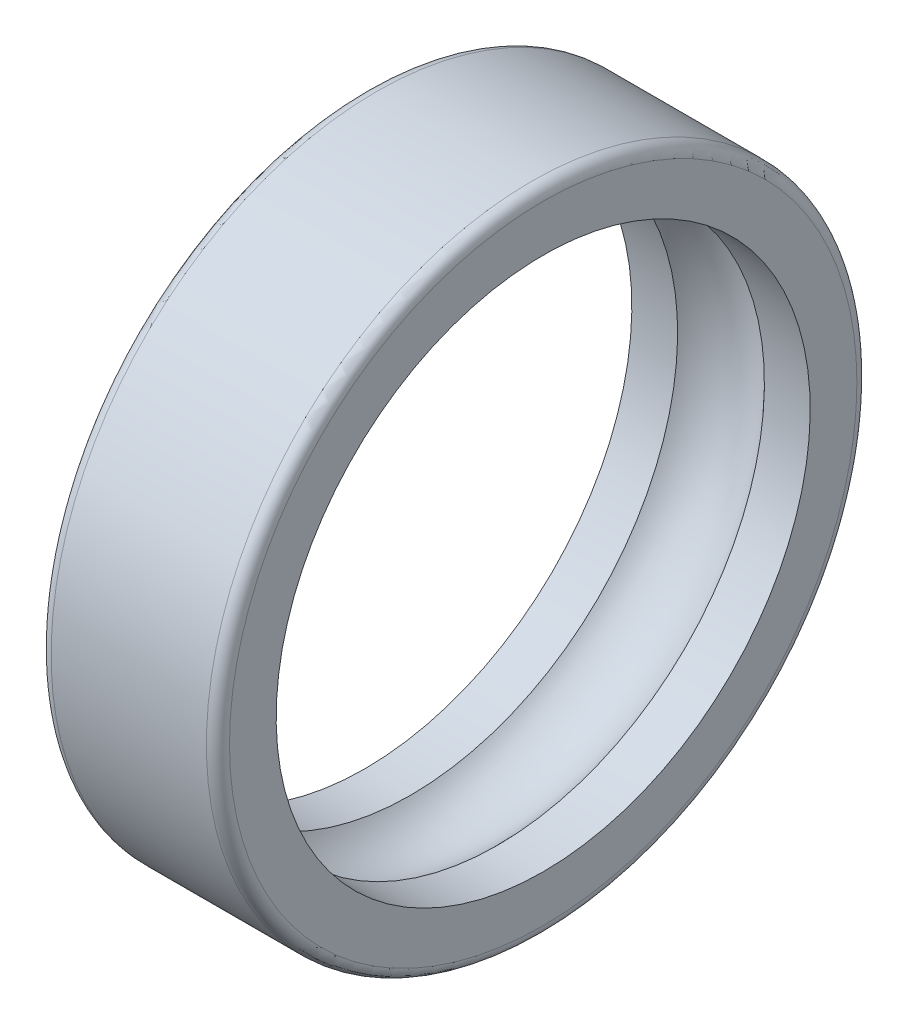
from build123d import *


with BuildPart() as part:
    # Esquisse1 → R_volution1 (revolve)
    with BuildSketch(Plane.XY, mode=Mode.PRIVATE) as r_volution1_sk:
        with BuildLine():
            Line((1.1, 31), (15.9, 31))
            ThreePointArc((15.9, 31), (16.677817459, 30.677817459), (17, 29.9))
            Line((17, 29.9), (17, 25.45))
            Line((17, 25.45), (12.636725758, 25.45))
            ThreePointArc((12.636725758, 25.45), (8.5, 27.3), (4.363274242, 25.45))
            Line((4.363274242, 25.45), (0, 25.45))
            Line((0, 25.45), (0, 29.9))
            ThreePointArc((0, 29.9), (0.322182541, 30.677817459), (1.1, 31))
        make_face()
    revolve(r_volution1_sk.sketch.rotate(Axis((0, 0, 0), (1, 0, 0)), 180), axis=Axis((0, 0, 0), (1, 0, 0)))


solid = part.part
